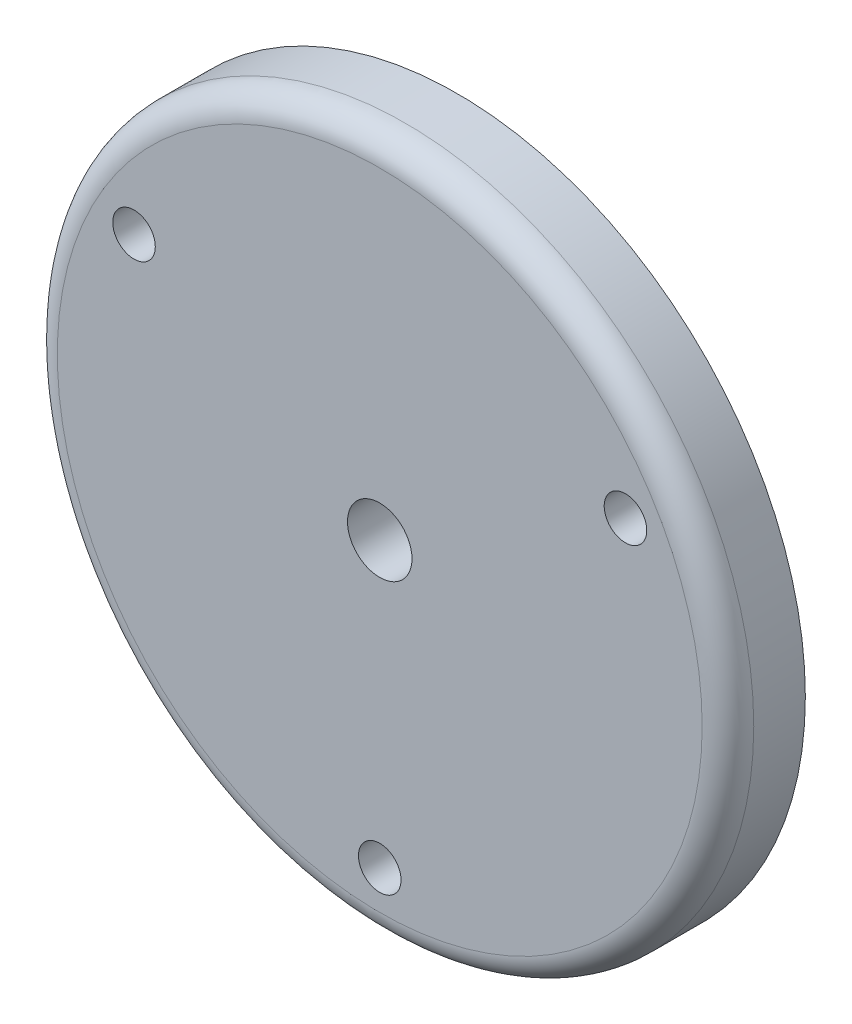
from build123d import *

# Parameters (mm, degrees)
SKETCH_1_R             = 27
EXTRUDE_1_DEPTH        = 6
SKETCH_2_R             = 17.5
SKETCH_2_R_2           = 14
EXTRUDE_2_DEPTH        = 4
SKETCH_3_R             = 1.65
CUT_EXTRUDE_2_DEPTH    = 85.882271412
HOLE_WIZARD_M6_1_D     = 5
HOLE_WIZARD_M6_1_DEPTH = 16
HOLE_WIZARD_M6_1_TIP   = 1.502151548
FILLET_1_R             = 2


with BuildPart() as part:
    # Sketch 1 → Extrude 1 (new body)
    with BuildSketch(Plane.XY.offset(2)):
        with Locations((3, 52)):
            Circle(SKETCH_1_R)
    extrude(amount=EXTRUDE_1_DEPTH)

    # Sketch 2 → Extrude 2 (add)
    with BuildSketch(Plane(origin=(0, 0, 2), x_dir=(-1, 0, 0), z_dir=(0, 0, -1))):
        with Locations(Location((-3, 52, 0), (0, 0, 180))):
            Circle(SKETCH_2_R)
        with Locations((-3, 52)):
            Circle(SKETCH_2_R_2, mode=Mode.SUBTRACT)
    extrude(amount=EXTRUDE_2_DEPTH)

    # Sketch 3 → Cut-Extrude 2 (cut, through all)
    with BuildSketch(Plane.XY):
        with Locations((3, 30)):
            Circle(SKETCH_3_R)
        with Locations((22.052558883, 63)):
            Circle(SKETCH_3_R)
        with Locations((-16.052558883, 63)):
            Circle(SKETCH_3_R)
    extrude(amount=CUT_EXTRUDE_2_DEPTH, mode=Mode.SUBTRACT)

    # Hole Wizard M6 _1
    with Locations(Plane.XY.offset(8)):
        with Locations((3, 52)):
            Hole(HOLE_WIZARD_M6_1_D / 2, depth=HOLE_WIZARD_M6_1_DEPTH)
            with Locations((0, 0, -(HOLE_WIZARD_M6_1_DEPTH + HOLE_WIZARD_M6_1_TIP / 2))):  # 118° drill point
                Cone(0, HOLE_WIZARD_M6_1_D / 2, HOLE_WIZARD_M6_1_TIP, mode=Mode.SUBTRACT)

    # Fillet 1
    fillet_1_edges = [part.edges().sort_by_distance(p)[0] for p in [
        (-24, 52, 8),
    ]]
    fillet(fillet_1_edges, radius=FILLET_1_R)


solid = part.part
